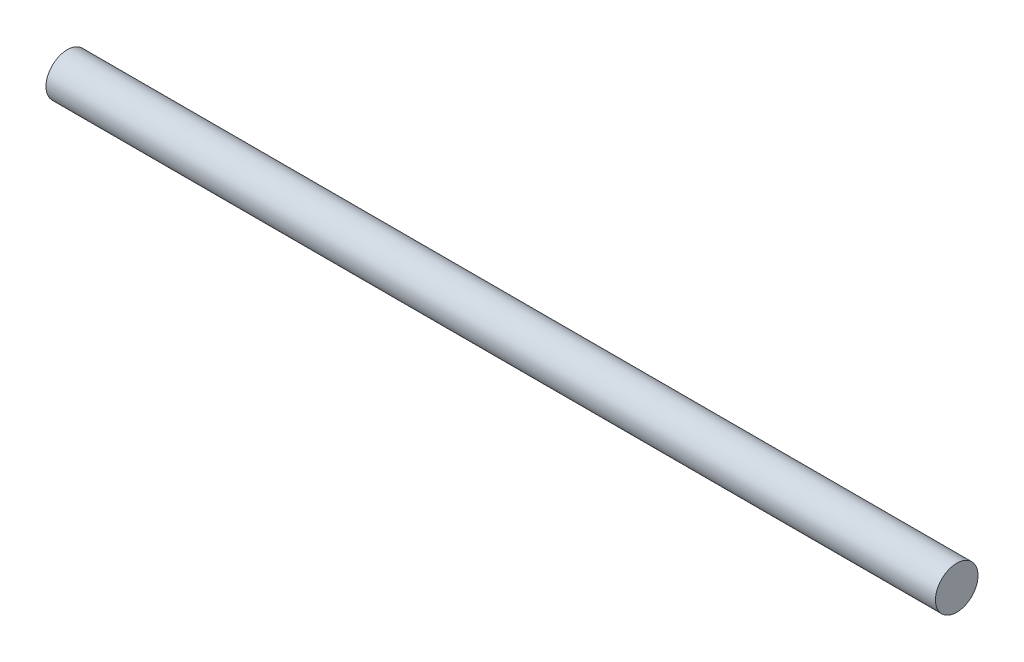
ISO-10303-21;
HEADER;
FILE_DESCRIPTION(('STEP AP214'),'2;1');
FILE_NAME('part.step','',(''),(''),'','','');
FILE_SCHEMA(('AUTOMOTIVE_DESIGN { 1 0 10303 214 1 1 1 1 }'));
ENDSEC;
DATA;
#1=APPLICATION_CONTEXT('core data for automotive mechanical design processes');
#2=APPLICATION_PROTOCOL_DEFINITION('international standard','automotive_design',2000,#1);
#3=PRODUCT_CONTEXT('',#1,'mechanical');
#4=PRODUCT('Part','Part','',(#3));
#5=PRODUCT_RELATED_PRODUCT_CATEGORY('part','',(#4));
#6=PRODUCT_DEFINITION_FORMATION('','',#4);
#7=PRODUCT_DEFINITION_CONTEXT('part definition',#1,'design');
#8=PRODUCT_DEFINITION('design','',#6,#7);
#9=PRODUCT_DEFINITION_SHAPE('','',#8);
#10=(LENGTH_UNIT() NAMED_UNIT(*) SI_UNIT(.MILLI.,.METRE.));
#11=(NAMED_UNIT(*) PLANE_ANGLE_UNIT() SI_UNIT($,.RADIAN.));
#12=(NAMED_UNIT(*) SI_UNIT($,.STERADIAN.) SOLID_ANGLE_UNIT());
#13=UNCERTAINTY_MEASURE_WITH_UNIT(LENGTH_MEASURE(1.E-05),#10,'distance_accuracy_value','');
#14=(GEOMETRIC_REPRESENTATION_CONTEXT(3) GLOBAL_UNCERTAINTY_ASSIGNED_CONTEXT((#13)) GLOBAL_UNIT_ASSIGNED_CONTEXT((#10,
#11,#12)) REPRESENTATION_CONTEXT('',''));
#15=CARTESIAN_POINT('',(0.,0.,0.));
#16=DIRECTION('',(0.,0.,1.));
#17=DIRECTION('',(1.,0.,0.));
#18=AXIS2_PLACEMENT_3D('',#15,#16,#17);
#19=CARTESIAN_POINT('',(106.68,2.55249999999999,0.));
#20=DIRECTION('',(-1.,0.,0.));
#21=DIRECTION('',(0.,-1.,0.));
#22=AXIS2_PLACEMENT_3D('',#19,#20,#21);
#23=PLANE('',#22);
#24=CARTESIAN_POINT('',(106.68,0.,0.));
#25=DIRECTION('',(-1.,0.,0.));
#26=DIRECTION('',(0.,-1.,0.));
#27=AXIS2_PLACEMENT_3D('',#24,#25,#26);
#28=CIRCLE('',#27,2.55249999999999);
#29=CARTESIAN_POINT('',(106.68,-2.55249999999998,0.));
#30=VERTEX_POINT('',#29);
#31=EDGE_CURVE('E10',#30,#30,#28,.T.);
#32=ORIENTED_EDGE('',*,*,#31,.F.);
#33=EDGE_LOOP('',(#32));
#34=FACE_BOUND('',#33,.T.);
#35=ADVANCED_FACE('F31',(#34),#23,.F.);
#36=CARTESIAN_POINT('',(106.68,0.,0.));
#37=DIRECTION('',(-1.,0.,0.));
#38=DIRECTION('',(0.,-1.,0.));
#39=AXIS2_PLACEMENT_3D('',#36,#37,#38);
#40=CYLINDRICAL_SURFACE('',#39,2.55249999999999);
#41=CARTESIAN_POINT('',(0.,0.,0.));
#42=DIRECTION('',(-1.,0.,0.));
#43=DIRECTION('',(0.,-1.,0.));
#44=AXIS2_PLACEMENT_3D('',#41,#42,#43);
#45=CIRCLE('',#44,2.5525);
#46=CARTESIAN_POINT('',(0.,-2.5525,0.));
#47=VERTEX_POINT('',#46);
#48=EDGE_CURVE('E37',#47,#47,#45,.T.);
#49=ORIENTED_EDGE('',*,*,#48,.F.);
#50=EDGE_LOOP('',(#49));
#51=FACE_BOUND('',#50,.T.);
#52=ORIENTED_EDGE('',*,*,#31,.T.);
#53=EDGE_LOOP('',(#52));
#54=FACE_BOUND('',#53,.T.);
#55=ADVANCED_FACE('F45',(#51,#54),#40,.T.);
#56=CARTESIAN_POINT('',(0.,0.,0.));
#57=DIRECTION('',(1.,0.,0.));
#58=DIRECTION('',(0.,1.,0.));
#59=AXIS2_PLACEMENT_3D('',#56,#57,#58);
#60=PLANE('',#59);
#61=ORIENTED_EDGE('',*,*,#48,.T.);
#62=EDGE_LOOP('',(#61));
#63=FACE_BOUND('',#62,.T.);
#64=ADVANCED_FACE('F43',(#63),#60,.F.);
#65=CLOSED_SHELL('',(#35,#55,#64));
#66=MANIFOLD_SOLID_BREP('B2',#65);
#67=ADVANCED_BREP_SHAPE_REPRESENTATION('',(#18,#66),#14);
#68=SHAPE_DEFINITION_REPRESENTATION(#9,#67);
ENDSEC;
END-ISO-10303-21;
